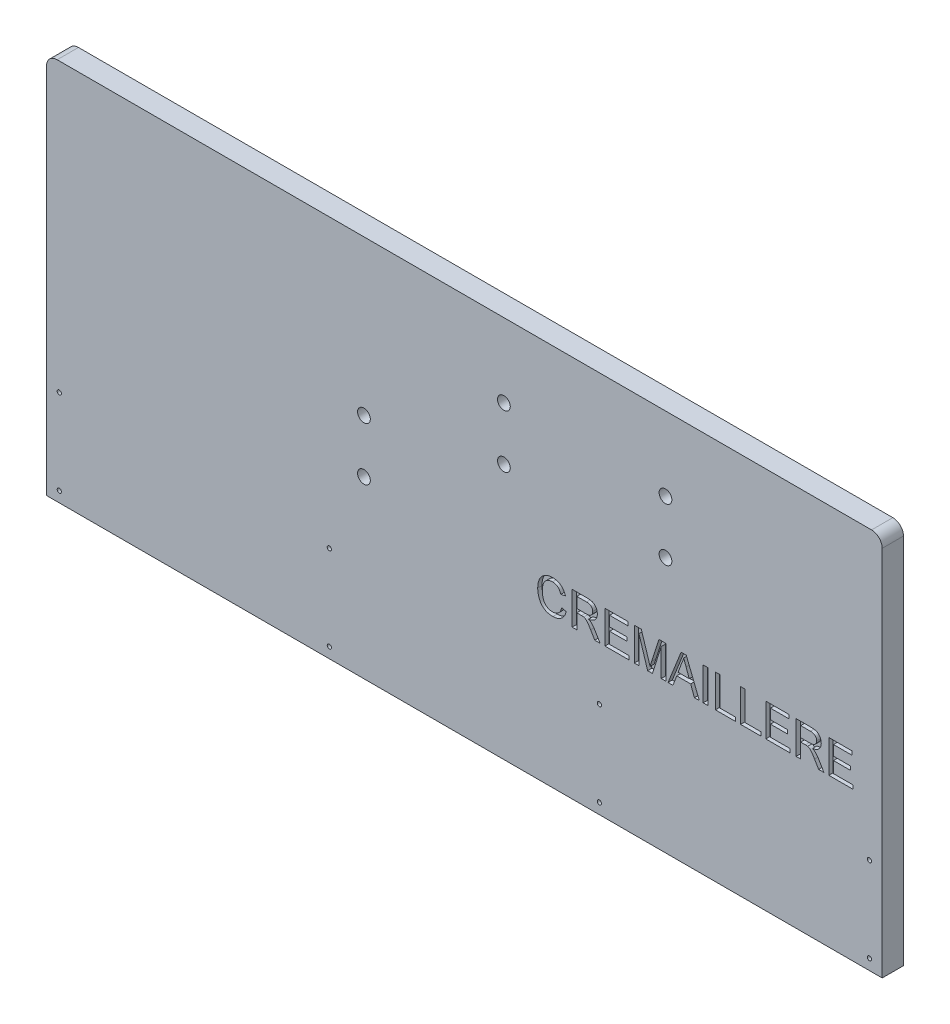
from build123d import *

# Parameters (mm, degrees)
ESQUISSE1_R             = 3
EXTRUSION1_DEPTH        = 10
ESQUISSE2_R             = 1
ENL_V_MAT_EXTRU_1_DEPTH = 2
ESQUISSE3_W             = 2.173192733
ESQUISSE3_H             = 15.409912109
ENL_V_MAT_EXTRU_2_DEPTH = 2


with BuildPart() as part:
    # Esquisse1 → Extrusion1 (new body)
    with BuildSketch(Plane.XY):
        with BuildLine():
            Line((0, 0), (393, 0))
            Line((393, 0), (393, 175))
            ThreePointArc((393, 175), (391.535533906, 178.535533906), (388, 180))
            Line((388, 180), (5, 180))
            ThreePointArc((5, 180), (1.464466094, 178.535533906), (0, 175))
            Line((0, 175), (0, 0))
        make_face()
        with Locations((149.27, 107.25)):
            Circle(ESQUISSE1_R, mode=Mode.SUBTRACT)
        with Locations((149.27, 82.25)):
            Circle(ESQUISSE1_R, mode=Mode.SUBTRACT)
        with Locations((215.087930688, 145.25)):
            Circle(ESQUISSE1_R, mode=Mode.SUBTRACT)
        with Locations((215.087930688, 120.25)):
            Circle(ESQUISSE1_R, mode=Mode.SUBTRACT)
        with Locations((291.087930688, 145.25)):
            Circle(ESQUISSE1_R, mode=Mode.SUBTRACT)
        with Locations((291.087930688, 120.25)):
            Circle(ESQUISSE1_R, mode=Mode.SUBTRACT)
    extrude(amount=EXTRUSION1_DEPTH)

    # Esquisse2 → Enl_v. mat.-Extru.1 (cut)
    with BuildSketch(Plane.XY.offset(10)):
        with Locations((6, 5)):
            Circle(ESQUISSE2_R)
        with Locations((133, 5)):
            Circle(ESQUISSE2_R)
        with Locations((260, 5)):
            Circle(ESQUISSE2_R)
        with Locations((387, 5)):
            Circle(ESQUISSE2_R)
        with Locations(Location((6, 45, 0), (0, 0, 180))):
            Circle(ESQUISSE2_R)
        with Locations(Location((133, 45, 0), (0, 0, 180))):
            Circle(ESQUISSE2_R)
        with Locations(Location((260, 45, 0), (0, 0, 180))):
            Circle(ESQUISSE2_R)
        with Locations(Location((387, 45, 0), (0, 0, 180))):
            Circle(ESQUISSE2_R)
    extrude(amount=-ENL_V_MAT_EXTRU_1_DEPTH, mode=Mode.SUBTRACT)

    # Esquisse3 → Enl_v. mat.-Extru.2 (cut)
    # profile 1 of 11: a face of its own
    with BuildSketch(Plane.XY.offset(10)):
        with BuildLine():
            Line((242.248904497, 75.439155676), (244.422097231, 74.932900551))
            add(Edge.make_bspline(
                [(244.422097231, 74.932900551), (244.367652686, 74.729213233), (244.2611524, 74.330775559), (244.050588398, 73.760567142), (243.814256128, 73.225450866), (243.546421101, 72.726836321), (243.244151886, 72.267590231), (242.915457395, 71.841810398), (242.547318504, 71.458425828), (242.153242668, 71.108588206), (241.730161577, 70.800032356), (241.283176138, 70.533588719), (240.814446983, 70.30689927), (240.322079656, 70.120483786), (239.80575495, 69.980190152), (239.268131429, 69.877935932), (238.707641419, 69.814953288), (238.325592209, 69.806661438), (238.130951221, 69.802437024)],
                knots=[0, 0, 0, 0, 1.145254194, 2.240259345, 3.299159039, 4.322497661, 5.312016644, 6.284080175, 7.241264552, 8.196044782, 9.144516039, 10.082428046, 11.020306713, 11.970622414, 12.939253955, 13.924100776, 14.94240044, 16, 16, 16, 16], degree=3))
            add(Edge.make_bspline(
                [(238.130951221, 69.802437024), (237.931245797, 69.805338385), (237.540538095, 69.811014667), (236.968173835, 69.857184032), (236.423799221, 69.93725761), (235.90843086, 70.048508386), (235.420334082, 70.186063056), (234.961532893, 70.359119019), (234.532830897, 70.566427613), (234.130652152, 70.802191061), (233.756704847, 71.070028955), (233.40248529, 71.362713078), (233.076592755, 71.6883007), (232.770878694, 72.039104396), (232.492001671, 72.419751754), (232.229701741, 72.825071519), (231.996781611, 73.26220541), (231.784609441, 73.723048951), (231.598381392, 74.20314035), (231.433634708, 74.692996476), (231.298945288, 75.19359342), (231.182986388, 75.700718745), (231.098747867, 76.218639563), (231.031865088, 76.743469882), (230.995091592, 77.278427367), (230.990252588, 77.638021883), (230.987814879, 77.81917215)],
                knots=[0, 0, 0, 0, 1.180702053, 2.309949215, 3.392367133, 4.431746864, 5.425408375, 6.388154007, 7.326956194, 8.237882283, 9.141054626, 10.043899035, 10.951650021, 11.86168169, 12.792564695, 13.739356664, 14.713891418, 15.718426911, 16.737522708, 17.757217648, 18.772674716, 19.801476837, 20.831699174, 21.873853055, 22.928926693, 24, 24, 24, 24], degree=3))
            add(Edge.make_bspline(
                [(230.987814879, 77.81917215), (230.991301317, 78.014731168), (230.998189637, 78.401106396), (231.037074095, 78.97121426), (231.108490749, 79.521438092), (231.207667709, 80.052139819), (231.33316624, 80.563749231), (231.488080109, 81.056515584), (231.670449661, 81.529808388), (231.879718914, 81.984149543), (232.117278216, 82.414467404), (232.376037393, 82.821373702), (232.662168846, 83.198187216), (232.967189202, 83.552107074), (233.298716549, 83.877240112), (233.655738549, 84.174322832), (234.035174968, 84.446065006), (234.436970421, 84.689943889), (234.855872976, 84.903934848), (235.28566058, 85.09453846), (235.728042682, 85.250764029), (236.179511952, 85.38065931), (236.641040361, 85.48406802), (237.113706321, 85.553217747), (237.597073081, 85.598281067), (237.922996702, 85.604388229), (238.08773432, 85.607475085)],
                knots=[0, 0, 0, 0, 1.185634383, 2.342514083, 3.462112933, 4.547331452, 5.613960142, 6.653690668, 7.676612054, 8.686959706, 9.683658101, 10.654407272, 11.607580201, 12.5494388, 13.484601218, 14.419076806, 15.362504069, 16.311442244, 17.265594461, 18.212500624, 19.159571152, 20.107257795, 21.059246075, 22.024387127, 23.001429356, 24, 24, 24, 24], degree=3))
            add(Edge.make_bspline(
                [(238.08773432, 85.607475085), (238.272053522, 85.604000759), (238.634351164, 85.597171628), (239.165958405, 85.541000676), (239.675099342, 85.446920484), (240.163980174, 85.32349617), (240.6275181, 85.154502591), (241.070745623, 84.953588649), (241.489253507, 84.712214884), (241.8862981, 84.437014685), (242.255416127, 84.127480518), (242.601773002, 83.79100707), (242.91124611, 83.419184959), (243.196092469, 83.021012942), (243.447349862, 82.590969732), (243.674261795, 82.132804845), (243.869399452, 81.643112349), (243.973807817, 81.30202798), (244.026971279, 81.128351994)],
                knots=[0, 0, 0, 0, 1.098391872, 2.158997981, 3.181470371, 4.182549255, 5.160268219, 6.118029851, 7.079534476, 8.035645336, 8.993622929, 9.94770573, 10.909620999, 11.872786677, 12.862530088, 13.874594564, 14.917769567, 16, 16, 16, 16], degree=3))
            Line((244.026971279, 81.128351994), (241.853778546, 80.662226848))
            add(Edge.make_bspline(
                [(241.853778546, 80.662226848), (241.811100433, 80.79551425), (241.72756616, 81.056398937), (241.579242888, 81.428205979), (241.419058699, 81.773364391), (241.243197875, 82.08952794), (241.051279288, 82.376772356), (240.847722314, 82.638588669), (240.627649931, 82.870090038), (240.395538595, 83.076614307), (240.145394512, 83.252553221), (239.883082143, 83.408464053), (239.603070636, 83.537456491), (239.309388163, 83.646557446), (238.999289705, 83.729595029), (238.674038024, 83.788015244), (238.333347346, 83.821826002), (238.101185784, 83.826847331), (237.982778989, 83.829408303)],
                knots=[0, 0, 0, 0, 1.235697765, 2.418642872, 3.532555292, 4.594392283, 5.610119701, 6.580908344, 7.519430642, 8.427315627, 9.319973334, 10.216139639, 11.118687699, 12.038725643, 12.980015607, 13.949697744, 14.954307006, 16, 16, 16, 16], degree=3))
            add(Edge.make_bspline(
                [(237.982778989, 83.829408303), (237.846837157, 83.827435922), (237.579479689, 83.823556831), (237.186699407, 83.781100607), (236.809493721, 83.718566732), (236.450673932, 83.624791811), (236.108276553, 83.507878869), (235.784333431, 83.362301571), (235.476088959, 83.191667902), (235.186983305, 82.994953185), (234.919446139, 82.773807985), (234.666217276, 82.540022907), (234.439454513, 82.28269475), (234.230510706, 82.010308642), (234.04547029, 81.718051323), (233.878902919, 81.409903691), (233.731870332, 81.083340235), (233.571594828, 80.623726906), (233.40817247, 80.031755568), (233.266403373, 79.307374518), (233.1760998, 78.571580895), (233.166048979, 78.076672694), (233.161007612, 77.828432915)],
                knots=[0, 0, 0, 0, 0.935256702, 1.839373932, 2.716087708, 3.564631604, 4.388828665, 5.203538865, 6.005592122, 6.810952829, 7.606223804, 8.392839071, 9.180346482, 9.963639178, 10.753404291, 11.558266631, 12.372976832, 13.215232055, 14.905983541, 16.594894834, 18.292041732, 20, 20, 20, 20], degree=3))
            add(Edge.make_bspline(
                [(233.161007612, 77.828432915), (233.166693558, 77.516312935), (233.177724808, 76.91077191), (233.286576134, 76.033242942), (233.452534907, 75.214744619), (233.652823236, 74.576152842), (233.853732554, 74.105115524), (234.016217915, 73.775241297), (234.201688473, 73.46999169), (234.405530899, 73.187633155), (234.630370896, 72.928989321), (234.873075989, 72.692686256), (235.133700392, 72.476450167), (235.415332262, 72.290403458), (235.707131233, 72.125210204), (236.005415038, 71.978317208), (236.31037148, 71.854081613), (236.623230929, 71.75757288), (236.939600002, 71.674175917), (237.262963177, 71.619697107), (237.593228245, 71.588950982), (237.814993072, 71.583342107), (237.927214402, 71.580503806)],
                knots=[0, 0, 0, 0, 2.10686522, 4.087509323, 5.961373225, 7.741398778, 8.594514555, 9.418024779, 10.222433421, 11.003575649, 11.767087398, 12.533660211, 13.289033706, 14.050297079, 14.809623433, 15.552362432, 16.294320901, 17.0305302, 17.761969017, 18.502233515, 19.242073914, 20, 20, 20, 20], degree=3))
            add(Edge.make_bspline(
                [(237.927214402, 71.580503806), (238.061135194, 71.583312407), (238.32567611, 71.588860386), (238.713526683, 71.637422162), (239.087409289, 71.708984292), (239.442794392, 71.819411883), (239.784462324, 71.954617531), (240.1096137, 72.121349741), (240.41722597, 72.321879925), (240.710917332, 72.549563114), (240.985271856, 72.808627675), (241.236703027, 73.096986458), (241.462265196, 73.415954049), (241.671418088, 73.760411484), (241.847144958, 74.140648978), (242.009909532, 74.545333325), (242.145536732, 74.981115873), (242.213953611, 75.284282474), (242.248904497, 75.439155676)],
                knots=[0, 0, 0, 0, 1.013374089, 2.001772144, 2.95501459, 3.891367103, 4.814208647, 5.733921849, 6.652182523, 7.590185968, 8.54346024, 9.504121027, 10.481158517, 11.497760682, 12.549996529, 13.647863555, 14.798406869, 16, 16, 16, 16], degree=3))
        make_face()
    # profile 2 of 11: a face of its own
    with BuildSketch(Plane.XY.offset(10)):
        with BuildLine():
            Line((247.187978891, 70), (247.187978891, 85.409912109))
            Line((247.187978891, 85.409912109), (253.874250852, 85.409912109))
            add(Edge.make_bspline(
                [(253.874250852, 85.409912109), (254.031692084, 85.408678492), (254.336401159, 85.40629097), (254.778292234, 85.389390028), (255.190753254, 85.352956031), (255.574542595, 85.31355774), (255.929592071, 85.253086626), (256.255535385, 85.183727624), (256.552875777, 85.101189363), (256.82294254, 85.003705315), (257.073505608, 84.893416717), (257.305758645, 84.757338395), (257.529356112, 84.608225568), (257.735999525, 84.43304025), (257.931139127, 84.241228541), (258.114594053, 84.030184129), (258.283648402, 83.798075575), (258.492156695, 83.465880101), (258.715843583, 83.023465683), (258.902209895, 82.457271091), (259.022375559, 81.86501088), (259.035233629, 81.460269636), (259.041757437, 81.254915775)],
                knots=[0, 0, 0, 0, 1.242255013, 2.404239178, 3.487702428, 4.508875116, 5.447164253, 6.327763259, 7.137389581, 7.87956647, 8.591787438, 9.293660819, 10.000726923, 10.709654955, 11.427269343, 12.158170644, 12.913245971, 13.690346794, 15.251572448, 16.809945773, 18.381459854, 20, 20, 20, 20], degree=3))
            add(Edge.make_bspline(
                [(259.041757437, 81.254915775), (259.038741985, 81.123096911), (259.03278626, 80.862745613), (258.98716481, 80.479959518), (258.904616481, 80.114222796), (258.798764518, 79.762332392), (258.653885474, 79.429274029), (258.486049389, 79.10824489), (258.278124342, 78.8080645), (258.04532926, 78.520739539), (257.778375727, 78.252423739), (257.474915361, 78.012797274), (257.137956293, 77.79725279), (256.765911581, 77.611737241), (256.363063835, 77.442167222), (255.924358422, 77.305621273), (255.45156592, 77.194121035), (255.12380418, 77.140128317), (254.954673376, 77.112267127)],
                knots=[0, 0, 0, 0, 0.982609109, 1.940720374, 2.867584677, 3.775009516, 4.675469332, 5.571146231, 6.471115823, 7.392408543, 8.32534739, 9.286126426, 10.269214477, 11.301811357, 12.381622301, 13.524260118, 14.722474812, 16, 16, 16, 16], degree=3))
            add(Edge.make_bspline(
                [(254.954673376, 77.112267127), (255.078737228, 77.049592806), (255.314338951, 76.930572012), (255.640532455, 76.743948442), (255.917035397, 76.553265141), (256.077227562, 76.416882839), (256.152398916, 76.352884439)],
                knots=[0, 0, 0, 0, 1.172304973, 2.226249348, 3.167654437, 4, 4, 4, 4], degree=3))
            add(Edge.make_bspline(
                [(256.152398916, 76.352884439), (256.29797249, 76.210179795), (256.596990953, 75.917054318), (257.009051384, 75.417775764), (257.408558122, 74.86200212), (257.651288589, 74.460342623), (257.776119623, 74.253777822)],
                knots=[0, 0, 0, 0, 0.918110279, 1.885863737, 2.912745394, 4, 4, 4, 4], degree=3))
            Line((257.776119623, 74.253777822), (260.304308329, 70))
            Line((260.304308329, 70), (257.813162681, 70))
            Line((257.813162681, 70), (255.893097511, 73.253615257))
            add(Edge.make_bspline(
                [(255.893097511, 73.253615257), (255.824061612, 73.367772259), (255.690281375, 73.588989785), (255.497040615, 73.912067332), (255.307574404, 74.209511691), (255.131847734, 74.489823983), (254.962729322, 74.747915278), (254.801853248, 74.984682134), (254.653646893, 75.203230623), (254.470074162, 75.45767794), (254.256425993, 75.739226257), (254.007113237, 76.029167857), (253.769693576, 76.260334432), (253.477306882, 76.48701785), (253.115141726, 76.699042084), (252.807294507, 76.796461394), (252.658003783, 76.843704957)],
                knots=[0, 0, 0, 0, 1.130940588, 2.191577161, 3.191089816, 4.120344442, 4.99615009, 5.80661983, 6.546979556, 7.234477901, 8.466216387, 9.541989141, 10.473533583, 11.269175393, 12.675684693, 14, 14, 14, 14], degree=3))
            add(Edge.make_bspline(
                [(252.658003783, 76.843704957), (252.595366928, 76.855000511), (252.45236511, 76.880788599), (252.209548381, 76.89763084), (251.915346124, 76.915506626), (251.702132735, 76.914985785), (251.586842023, 76.914704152)],
                knots=[0, 0, 0, 0, 0.709978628, 1.620902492, 2.713552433, 4, 4, 4, 4], degree=3))
            Line((251.586842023, 76.914704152), (249.361171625, 76.914704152))
            Line((249.361171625, 76.914704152), (249.361171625, 70))
            Line((249.361171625, 70), (247.187978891, 70))
        make_face()
        with BuildLine():
            Line((249.361171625, 78.692770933), (253.488385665, 78.692770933))
            add(Edge.make_bspline(
                [(253.488385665, 78.692770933), (253.69533981, 78.696008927), (254.082221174, 78.702062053), (254.623213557, 78.753749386), (255.084259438, 78.835882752), (255.474473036, 78.955683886), (255.802314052, 79.122007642), (256.087443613, 79.32470422), (256.324389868, 79.578602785), (256.521504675, 79.865073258), (256.674726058, 80.180319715), (256.785252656, 80.511439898), (256.857594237, 80.855650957), (256.864875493, 81.089916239), (256.868564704, 81.208611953)],
                knots=[0, 0, 0, 0, 1.546323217, 2.890706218, 4.056530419, 5.041445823, 5.928701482, 6.793137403, 7.641659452, 8.509781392, 9.383301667, 10.251423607, 11.114044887, 12, 12, 12, 12], degree=3))
            add(Edge.make_bspline(
                [(256.868564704, 81.208611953), (256.865696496, 81.295110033), (256.860078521, 81.464534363), (256.830627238, 81.71320224), (256.77336695, 81.949494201), (256.697754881, 82.174659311), (256.596721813, 82.387048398), (256.476698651, 82.58830724), (256.333473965, 82.777320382), (256.169418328, 82.954663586), (255.981052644, 83.11602857), (255.765894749, 83.255251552), (255.52564158, 83.373561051), (255.260013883, 83.467459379), (254.969848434, 83.542562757), (254.653493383, 83.592526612), (254.312395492, 83.62868029), (254.076034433, 83.630770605), (253.954510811, 83.631845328)],
                knots=[0, 0, 0, 0, 0.965208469, 1.890559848, 2.786986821, 3.67262109, 4.535197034, 5.405224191, 6.282113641, 7.175449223, 8.095446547, 9.040936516, 10.026471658, 11.075712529, 12.17809725, 13.364958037, 14.645208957, 16, 16, 16, 16], degree=3))
            Line((253.954510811, 83.631845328), (249.361171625, 83.631845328))
            Line((249.361171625, 83.631845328), (249.361171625, 78.692770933))
        make_face(mode=Mode.SUBTRACT)
    # profile 3 of 11: a face of its own
    with BuildSketch(Plane.XY.offset(10)):
        Polygon((262.597891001, 70), (262.597891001, 85.409912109), (273.463854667, 85.409912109), (273.463854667, 83.631845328), (264.771083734, 83.631845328), (264.771083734, 78.890333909), (272.87116574, 78.890333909), (272.87116574, 77.112267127), (264.771083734, 77.112267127), (264.771083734, 71.778066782), (273.858980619, 71.778066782), (273.858980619, 70), align=None)
    # profile 4 of 11: a face of its own
    with BuildSketch(Plane.XY.offset(10)):
        with BuildLine():
            Line((276.427299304, 70), (276.427299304, 85.409912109))
            Line((276.427299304, 85.409912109), (279.696349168, 85.409912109))
            Line((279.696349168, 85.409912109), (283.141353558, 74.596426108))
            add(Edge.make_bspline(
                [(283.141353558, 74.596426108), (283.179265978, 74.473928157), (283.252586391, 74.23702425), (283.361311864, 73.894913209), (283.460233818, 73.576997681), (283.549328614, 73.282265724), (283.633408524, 73.012180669), (283.706208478, 72.764526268), (283.775807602, 72.542054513), (283.816595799, 72.400666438), (283.835910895, 72.333712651)],
                knots=[0, 0, 0, 0, 1.300204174, 2.514519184, 3.639827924, 4.676153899, 5.636536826, 6.507959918, 7.293450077, 8, 8, 8, 8], degree=3))
            add(Edge.make_bspline(
                [(283.835910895, 72.333712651), (283.857423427, 72.406798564), (283.90320347, 72.56233006), (283.977420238, 72.806876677), (284.056388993, 73.077495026), (284.150890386, 73.36953362), (284.249396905, 73.687573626), (284.352792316, 74.031350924), (284.47205691, 74.397433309), (284.551314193, 74.650877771), (284.592206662, 74.781641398)],
                knots=[0, 0, 0, 0, 0.713638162, 1.518667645, 2.393860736, 3.354087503, 4.393659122, 5.512594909, 6.716633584, 8, 8, 8, 8], degree=3))
            Line((284.592206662, 74.781641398), (288.003254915, 85.409912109))
            Line((288.003254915, 85.409912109), (291.244522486, 85.409912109))
            Line((291.244522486, 85.409912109), (291.244522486, 70))
            Line((291.244522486, 70), (289.071329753, 70))
            Line((289.071329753, 70), (289.071329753, 83.0391564))
            Line((289.071329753, 83.0391564), (284.95955032, 70))
            Line((284.95955032, 70), (282.687576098, 70))
            Line((282.687576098, 70), (278.600492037, 83.0391564))
            Line((278.600492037, 83.0391564), (278.600492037, 70))
            Line((278.600492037, 70), (276.427299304, 70))
        make_face()
    # profile 5 of 11: a face of its own
    with BuildSketch(Plane.XY.offset(10)):
        Polygon((292.297162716, 70), (298.415441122, 85.409912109), (300.86645679, 85.409912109), (306.984735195, 70), (304.678804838, 70), (302.925433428, 74.741511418), (296.356464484, 74.741511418), (294.603093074, 70), align=None)
        with BuildLine():
            Line((297.010891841, 76.5195782), (302.271006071, 76.5195782))
            Line((302.271006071, 76.5195782), (300.773849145, 80.569619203))
            add(Edge.make_bspline(
                [(300.773849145, 80.569619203), (300.716453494, 80.726107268), (300.604234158, 81.032070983), (300.436881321, 81.476610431), (300.283990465, 81.898763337), (300.134068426, 82.292476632), (299.998731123, 82.663469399), (299.873987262, 83.009235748), (299.750616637, 83.327372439), (299.676580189, 83.532921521), (299.640948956, 83.631845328)],
                knots=[0, 0, 0, 0, 1.225184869, 2.395467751, 3.491410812, 4.525364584, 5.492066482, 6.394148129, 7.227157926, 8, 8, 8, 8], degree=3))
            add(Edge.make_bspline(
                [(299.640948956, 83.631845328), (299.582008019, 83.387907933), (299.463883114, 82.899027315), (299.216558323, 82.182751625), (298.933627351, 81.473026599), (298.703853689, 81.015684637), (298.588308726, 80.785703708)],
                knots=[0, 0, 0, 0, 0.9891762, 1.982431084, 2.985436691, 4, 4, 4, 4], degree=3))
            Line((298.588308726, 80.785703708), (297.010891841, 76.5195782))
        make_face(mode=Mode.SUBTRACT)
    # profile 6 of 11: a face of its own
    with BuildSketch(Plane.XY.offset(10)):
        with Locations((309.914223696, 77.704956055)):
            Rectangle(ESQUISSE3_W, ESQUISSE3_H)
    # profile 7 of 11: a face of its own
    with BuildSketch(Plane.XY.offset(10)):
        Polygon((314.556953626, 70), (314.556953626, 85.409912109), (316.730146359, 85.409912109), (316.730146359, 71.778066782), (324.039976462, 71.778066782), (324.039976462, 70), align=None)
    # profile 8 of 11: a face of its own
    with BuildSketch(Plane.XY.offset(10)):
        Polygon((326.410732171, 70), (326.410732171, 85.409912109), (328.583924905, 85.409912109), (328.583924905, 71.778066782), (335.893755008, 71.778066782), (335.893755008, 70), align=None)
    # profile 9 of 11: a face of its own
    with BuildSketch(Plane.XY.offset(10)):
        Polygon((338.264510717, 70), (338.264510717, 85.409912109), (349.130474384, 85.409912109), (349.130474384, 83.631845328), (340.437703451, 83.631845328), (340.437703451, 78.890333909), (348.537785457, 78.890333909), (348.537785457, 77.112267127), (340.437703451, 77.112267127), (340.437703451, 71.778066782), (349.525600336, 71.778066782), (349.525600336, 70), align=None)
    # profile 10 of 11: a face of its own
    with BuildSketch(Plane.XY.offset(10)):
        with BuildLine():
            Line((352.489044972, 70), (352.489044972, 85.409912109))
            Line((352.489044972, 85.409912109), (359.175316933, 85.409912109))
            add(Edge.make_bspline(
                [(359.175316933, 85.409912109), (359.332758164, 85.408678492), (359.63746724, 85.40629097), (360.079358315, 85.389390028), (360.491819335, 85.352956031), (360.875608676, 85.31355774), (361.230658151, 85.253086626), (361.556601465, 85.183727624), (361.853941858, 85.101189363), (362.124008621, 85.003705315), (362.374571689, 84.893416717), (362.606824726, 84.757338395), (362.830422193, 84.608225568), (363.037065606, 84.43304025), (363.232205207, 84.241228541), (363.415660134, 84.030184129), (363.584714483, 83.798075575), (363.793222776, 83.465880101), (364.016909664, 83.023465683), (364.203275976, 82.457271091), (364.32344164, 81.86501088), (364.33629971, 81.460269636), (364.342823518, 81.254915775)],
                knots=[0, 0, 0, 0, 1.242255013, 2.404239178, 3.487702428, 4.508875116, 5.447164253, 6.327763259, 7.137389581, 7.87956647, 8.591787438, 9.293660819, 10.000726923, 10.709654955, 11.427269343, 12.158170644, 12.913245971, 13.690346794, 15.251572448, 16.809945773, 18.381459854, 20, 20, 20, 20], degree=3))
            add(Edge.make_bspline(
                [(364.342823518, 81.254915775), (364.339808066, 81.123096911), (364.333852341, 80.862745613), (364.288230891, 80.479959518), (364.205682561, 80.114222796), (364.099830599, 79.762332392), (363.954951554, 79.429274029), (363.78711547, 79.10824489), (363.579190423, 78.8080645), (363.34639534, 78.520739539), (363.079441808, 78.252423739), (362.775981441, 78.012797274), (362.439022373, 77.79725279), (362.066977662, 77.611737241), (361.664129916, 77.442167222), (361.225424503, 77.305621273), (360.752632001, 77.194121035), (360.424870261, 77.140128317), (360.255739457, 77.112267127)],
                knots=[0, 0, 0, 0, 0.982609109, 1.940720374, 2.867584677, 3.775009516, 4.675469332, 5.571146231, 6.471115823, 7.392408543, 8.32534739, 9.286126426, 10.269214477, 11.301811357, 12.381622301, 13.524260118, 14.722474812, 16, 16, 16, 16], degree=3))
            add(Edge.make_bspline(
                [(360.255739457, 77.112267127), (360.379803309, 77.049592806), (360.615405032, 76.930572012), (360.941598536, 76.743948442), (361.218101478, 76.553265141), (361.378293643, 76.416882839), (361.453464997, 76.352884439)],
                knots=[0, 0, 0, 0, 1.172304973, 2.226249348, 3.167654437, 4, 4, 4, 4], degree=3))
            add(Edge.make_bspline(
                [(361.453464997, 76.352884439), (361.599038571, 76.210179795), (361.898057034, 75.917054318), (362.310117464, 75.417775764), (362.709624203, 74.86200212), (362.952354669, 74.460342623), (363.077185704, 74.253777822)],
                knots=[0, 0, 0, 0, 0.918110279, 1.885863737, 2.912745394, 4, 4, 4, 4], degree=3))
            Line((363.077185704, 74.253777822), (365.60537441, 70))
            Line((365.60537441, 70), (363.114228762, 70))
            Line((363.114228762, 70), (361.194163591, 73.253615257))
            add(Edge.make_bspline(
                [(361.194163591, 73.253615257), (361.125127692, 73.367772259), (360.991347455, 73.588989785), (360.798106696, 73.912067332), (360.608640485, 74.209511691), (360.432913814, 74.489823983), (360.263795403, 74.747915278), (360.102919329, 74.984682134), (359.954712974, 75.203230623), (359.771140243, 75.45767794), (359.557492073, 75.739226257), (359.308179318, 76.029167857), (359.070759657, 76.260334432), (358.778372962, 76.48701785), (358.416207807, 76.699042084), (358.108360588, 76.796461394), (357.959069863, 76.843704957)],
                knots=[0, 0, 0, 0, 1.130940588, 2.191577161, 3.191089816, 4.120344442, 4.99615009, 5.80661983, 6.546979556, 7.234477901, 8.466216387, 9.541989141, 10.473533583, 11.269175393, 12.675684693, 14, 14, 14, 14], degree=3))
            add(Edge.make_bspline(
                [(357.959069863, 76.843704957), (357.896433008, 76.855000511), (357.753431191, 76.880788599), (357.510614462, 76.89763084), (357.216412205, 76.915506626), (357.003198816, 76.914985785), (356.887908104, 76.914704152)],
                knots=[0, 0, 0, 0, 0.709978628, 1.620902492, 2.713552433, 4, 4, 4, 4], degree=3))
            Line((356.887908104, 76.914704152), (354.662237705, 76.914704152))
            Line((354.662237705, 76.914704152), (354.662237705, 70))
            Line((354.662237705, 70), (352.489044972, 70))
        make_face()
        with BuildLine():
            Line((354.662237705, 78.692770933), (358.789451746, 78.692770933))
            add(Edge.make_bspline(
                [(358.789451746, 78.692770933), (358.996405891, 78.696008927), (359.383287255, 78.702062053), (359.924279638, 78.753749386), (360.385325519, 78.835882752), (360.775539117, 78.955683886), (361.103380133, 79.122007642), (361.388509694, 79.32470422), (361.625455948, 79.578602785), (361.822570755, 79.865073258), (361.975792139, 80.180319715), (362.086318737, 80.511439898), (362.158660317, 80.855650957), (362.165941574, 81.089916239), (362.169630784, 81.208611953)],
                knots=[0, 0, 0, 0, 1.546323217, 2.890706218, 4.056530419, 5.041445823, 5.928701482, 6.793137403, 7.641659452, 8.509781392, 9.383301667, 10.251423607, 11.114044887, 12, 12, 12, 12], degree=3))
            add(Edge.make_bspline(
                [(362.169630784, 81.208611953), (362.166762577, 81.295110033), (362.161144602, 81.464534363), (362.131693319, 81.71320224), (362.074433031, 81.949494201), (361.998820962, 82.174659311), (361.897787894, 82.387048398), (361.777764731, 82.58830724), (361.634540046, 82.777320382), (361.470484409, 82.954663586), (361.282118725, 83.11602857), (361.06696083, 83.255251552), (360.826707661, 83.373561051), (360.561079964, 83.467459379), (360.270914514, 83.542562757), (359.954559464, 83.592526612), (359.613461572, 83.62868029), (359.377100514, 83.630770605), (359.255576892, 83.631845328)],
                knots=[0, 0, 0, 0, 0.965208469, 1.890559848, 2.786986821, 3.67262109, 4.535197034, 5.405224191, 6.282113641, 7.175449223, 8.095446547, 9.040936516, 10.026471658, 11.075712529, 12.17809725, 13.364958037, 14.645208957, 16, 16, 16, 16], degree=3))
            Line((359.255576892, 83.631845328), (354.662237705, 83.631845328))
            Line((354.662237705, 83.631845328), (354.662237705, 78.692770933))
        make_face(mode=Mode.SUBTRACT)
    # profile 11 of 11: a face of its own
    with BuildSketch(Plane.XY.offset(10)):
        Polygon((367.898957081, 70), (367.898957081, 85.409912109), (378.764920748, 85.409912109), (378.764920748, 83.631845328), (370.072149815, 83.631845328), (370.072149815, 78.890333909), (378.172231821, 78.890333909), (378.172231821, 77.112267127), (370.072149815, 77.112267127), (370.072149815, 71.778066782), (379.1600467, 71.778066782), (379.1600467, 70), align=None)
    extrude(amount=-ENL_V_MAT_EXTRU_2_DEPTH, mode=Mode.SUBTRACT)


solid = part.part
